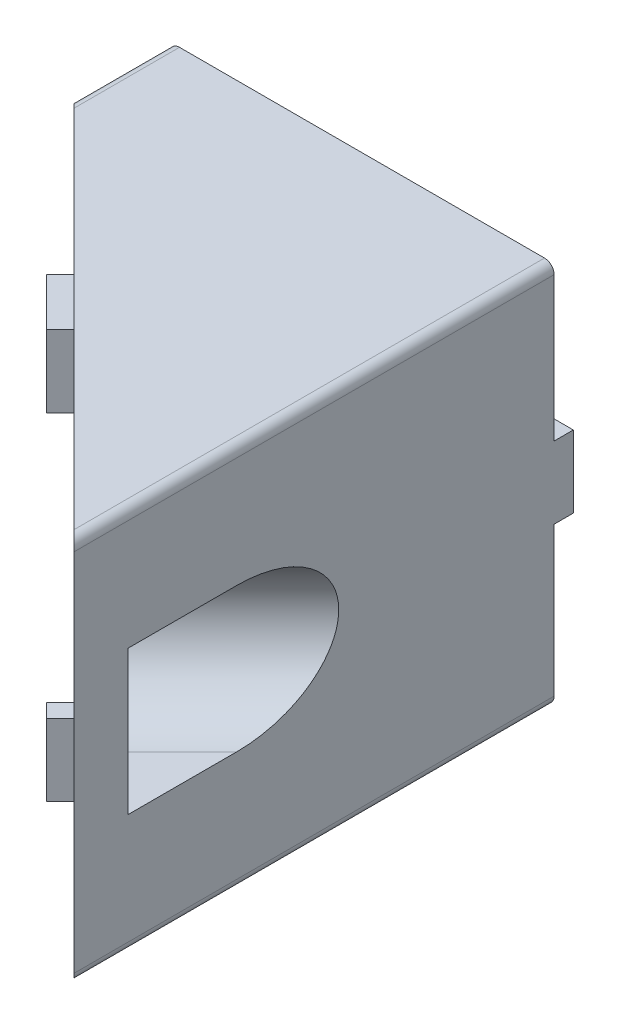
ISO-10303-21;
HEADER;
FILE_DESCRIPTION(('STEP AP214'),'2;1');
FILE_NAME('part.step','',(''),(''),'','','');
FILE_SCHEMA(('AUTOMOTIVE_DESIGN { 1 0 10303 214 1 1 1 1 }'));
ENDSEC;
DATA;
#1=APPLICATION_CONTEXT('core data for automotive mechanical design processes');
#2=APPLICATION_PROTOCOL_DEFINITION('international standard','automotive_design',2000,#1);
#3=PRODUCT_CONTEXT('',#1,'mechanical');
#4=PRODUCT('Part','Part','',(#3));
#5=PRODUCT_RELATED_PRODUCT_CATEGORY('part','',(#4));
#6=PRODUCT_DEFINITION_FORMATION('','',#4);
#7=PRODUCT_DEFINITION_CONTEXT('part definition',#1,'design');
#8=PRODUCT_DEFINITION('design','',#6,#7);
#9=PRODUCT_DEFINITION_SHAPE('','',#8);
#10=(LENGTH_UNIT() NAMED_UNIT(*) SI_UNIT(.MILLI.,.METRE.));
#11=(NAMED_UNIT(*) PLANE_ANGLE_UNIT() SI_UNIT($,.RADIAN.));
#12=(NAMED_UNIT(*) SI_UNIT($,.STERADIAN.) SOLID_ANGLE_UNIT());
#13=UNCERTAINTY_MEASURE_WITH_UNIT(LENGTH_MEASURE(1.E-05),#10,'distance_accuracy_value','');
#14=(GEOMETRIC_REPRESENTATION_CONTEXT(3) GLOBAL_UNCERTAINTY_ASSIGNED_CONTEXT((#13)) GLOBAL_UNIT_ASSIGNED_CONTEXT((#10,
#11,#12)) REPRESENTATION_CONTEXT('',''));
#15=CARTESIAN_POINT('',(0.,0.,0.));
#16=DIRECTION('',(0.,0.,1.));
#17=DIRECTION('',(1.,0.,0.));
#18=AXIS2_PLACEMENT_3D('',#15,#16,#17);
#19=CARTESIAN_POINT('',(0.,0.,-25.));
#20=DIRECTION('',(0.,0.,1.));
#21=DIRECTION('',(1.,0.,0.));
#22=AXIS2_PLACEMENT_3D('',#19,#20,#21);
#23=PLANE('',#22);
#24=CARTESIAN_POINT('',(0.,0.,-25.));
#25=DIRECTION('',(0.,0.,-1.));
#26=DIRECTION('',(-1.,0.,0.));
#27=AXIS2_PLACEMENT_3D('',#24,#25,#26);
#28=CIRCLE('',#27,4.);
#29=CARTESIAN_POINT('',(-4.,0.,-25.));
#30=VERTEX_POINT('',#29);
#31=EDGE_CURVE('E553',#30,#30,#28,.T.);
#32=ORIENTED_EDGE('',*,*,#31,.F.);
#33=EDGE_LOOP('',(#32));
#34=FACE_BOUND('',#33,.T.);
#35=DIRECTION('',(1.,0.,0.));
#36=VECTOR('',#35,1.);
#37=CARTESIAN_POINT('',(-20.,-20.,-25.));
#38=LINE('',#37,#36);
#39=CARTESIAN_POINT('',(-19.,-20.,-25.));
#40=VERTEX_POINT('',#39);
#41=CARTESIAN_POINT('',(19.,-20.,-25.));
#42=VERTEX_POINT('',#41);
#43=EDGE_CURVE('E359',#40,#42,#38,.T.);
#44=ORIENTED_EDGE('',*,*,#43,.F.);
#45=CARTESIAN_POINT('',(-19.,-19.,-25.));
#46=DIRECTION('',(0.,0.,1.));
#47=DIRECTION('',(1.,0.,0.));
#48=AXIS2_PLACEMENT_3D('',#45,#46,#47);
#49=CIRCLE('',#48,1.);
#50=CARTESIAN_POINT('',(-20.,-19.,-25.));
#51=VERTEX_POINT('',#50);
#52=EDGE_CURVE('E580',#40,#51,#49,.F.);
#53=ORIENTED_EDGE('',*,*,#52,.T.);
#54=DIRECTION('',(0.,-1.,0.));
#55=VECTOR('',#54,1.);
#56=CARTESIAN_POINT('',(-20.,20.,-25.));
#57=LINE('',#56,#55);
#58=CARTESIAN_POINT('',(-20.,-3.49999999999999,-25.));
#59=VERTEX_POINT('',#58);
#60=EDGE_CURVE('E556',#59,#51,#57,.T.);
#61=ORIENTED_EDGE('',*,*,#60,.F.);
#62=DIRECTION('',(-1.,0.,0.));
#63=VECTOR('',#62,1.);
#64=CARTESIAN_POINT('',(-20.,-3.49999999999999,-25.));
#65=LINE('',#64,#63);
#66=CARTESIAN_POINT('',(-18.,-3.49999999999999,-25.));
#67=VERTEX_POINT('',#66);
#68=EDGE_CURVE('E301',#67,#59,#65,.T.);
#69=ORIENTED_EDGE('',*,*,#68,.F.);
#70=DIRECTION('',(0.,-1.,0.));
#71=VECTOR('',#70,1.);
#72=CARTESIAN_POINT('',(-18.,4.00000000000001,-25.));
#73=LINE('',#72,#71);
#74=CARTESIAN_POINT('',(-18.,4.00000000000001,-25.));
#75=VERTEX_POINT('',#74);
#76=EDGE_CURVE('E1161',#75,#67,#73,.T.);
#77=ORIENTED_EDGE('',*,*,#76,.F.);
#78=DIRECTION('',(1.,0.,0.));
#79=VECTOR('',#78,1.);
#80=CARTESIAN_POINT('',(-20.,4.00000000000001,-25.));
#81=LINE('',#80,#79);
#82=CARTESIAN_POINT('',(-20.,4.00000000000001,-25.));
#83=VERTEX_POINT('',#82);
#84=EDGE_CURVE('E305',#83,#75,#81,.T.);
#85=ORIENTED_EDGE('',*,*,#84,.F.);
#86=CARTESIAN_POINT('',(-20.,19.,-25.));
#87=VERTEX_POINT('',#86);
#88=EDGE_CURVE('E560',#87,#83,#57,.T.);
#89=ORIENTED_EDGE('',*,*,#88,.F.);
#90=CARTESIAN_POINT('',(-19.,19.,-25.));
#91=DIRECTION('',(0.,0.,1.));
#92=DIRECTION('',(1.,0.,0.));
#93=AXIS2_PLACEMENT_3D('',#90,#91,#92);
#94=CIRCLE('',#93,1.);
#95=CARTESIAN_POINT('',(-19.,20.,-25.));
#96=VERTEX_POINT('',#95);
#97=EDGE_CURVE('E349',#87,#96,#94,.F.);
#98=ORIENTED_EDGE('',*,*,#97,.T.);
#99=DIRECTION('',(-1.,0.,0.));
#100=VECTOR('',#99,1.);
#101=CARTESIAN_POINT('',(-20.,20.,-25.));
#102=LINE('',#101,#100);
#103=CARTESIAN_POINT('',(19.,20.,-25.));
#104=VERTEX_POINT('',#103);
#105=EDGE_CURVE('E353',#104,#96,#102,.T.);
#106=ORIENTED_EDGE('',*,*,#105,.F.);
#107=CARTESIAN_POINT('',(19.,19.,-25.));
#108=DIRECTION('',(0.,0.,1.));
#109=DIRECTION('',(1.,0.,0.));
#110=AXIS2_PLACEMENT_3D('',#107,#108,#109);
#111=CIRCLE('',#110,1.);
#112=CARTESIAN_POINT('',(20.,19.,-25.));
#113=VERTEX_POINT('',#112);
#114=EDGE_CURVE('E620',#104,#113,#111,.F.);
#115=ORIENTED_EDGE('',*,*,#114,.T.);
#116=DIRECTION('',(0.,1.,0.));
#117=VECTOR('',#116,1.);
#118=CARTESIAN_POINT('',(20.,20.,-25.));
#119=LINE('',#118,#117);
#120=CARTESIAN_POINT('',(20.,4.00000000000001,-25.));
#121=VERTEX_POINT('',#120);
#122=EDGE_CURVE('E354',#121,#113,#119,.T.);
#123=ORIENTED_EDGE('',*,*,#122,.F.);
#124=DIRECTION('',(1.,0.,0.));
#125=VECTOR('',#124,1.);
#126=CARTESIAN_POINT('',(20.,4.00000000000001,-25.));
#127=LINE('',#126,#125);
#128=CARTESIAN_POINT('',(18.,4.00000000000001,-25.));
#129=VERTEX_POINT('',#128);
#130=EDGE_CURVE('E320',#129,#121,#127,.T.);
#131=ORIENTED_EDGE('',*,*,#130,.F.);
#132=DIRECTION('',(0.,1.,0.));
#133=VECTOR('',#132,1.);
#134=CARTESIAN_POINT('',(18.,4.00000000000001,-25.));
#135=LINE('',#134,#133);
#136=CARTESIAN_POINT('',(18.,-3.49999999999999,-25.));
#137=VERTEX_POINT('',#136);
#138=EDGE_CURVE('E310',#137,#129,#135,.T.);
#139=ORIENTED_EDGE('',*,*,#138,.F.);
#140=DIRECTION('',(-1.,0.,0.));
#141=VECTOR('',#140,1.);
#142=CARTESIAN_POINT('',(20.,-3.49999999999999,-25.));
#143=LINE('',#142,#141);
#144=CARTESIAN_POINT('',(20.,-3.49999999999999,-25.));
#145=VERTEX_POINT('',#144);
#146=EDGE_CURVE('E307',#145,#137,#143,.T.);
#147=ORIENTED_EDGE('',*,*,#146,.F.);
#148=CARTESIAN_POINT('',(20.,-19.,-25.));
#149=VERTEX_POINT('',#148);
#150=EDGE_CURVE('E350',#149,#145,#119,.T.);
#151=ORIENTED_EDGE('',*,*,#150,.F.);
#152=CARTESIAN_POINT('',(19.,-19.,-25.));
#153=DIRECTION('',(0.,0.,1.));
#154=DIRECTION('',(1.,0.,0.));
#155=AXIS2_PLACEMENT_3D('',#152,#153,#154);
#156=CIRCLE('',#155,1.);
#157=EDGE_CURVE('E607',#149,#42,#156,.F.);
#158=ORIENTED_EDGE('',*,*,#157,.T.);
#159=EDGE_LOOP('',(#44,#53,#61,#69,#77,#85,#89,#98,#106,#115,#123,#131,#139,#147,#151,#158));
#160=FACE_BOUND('',#159,.T.);
#161=ADVANCED_FACE('F36',(#34,#160),#23,.F.);
#162=CARTESIAN_POINT('',(20.,20.,25.));
#163=DIRECTION('',(0.707106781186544,0.,-0.707106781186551));
#164=DIRECTION('',(-0.707106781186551,0.,-0.707106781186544));
#165=AXIS2_PLACEMENT_3D('',#162,#163,#164);
#166=PLANE('',#165);
#167=DIRECTION('',(0.707106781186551,0.,0.707106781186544));
#168=VECTOR('',#167,1.);
#169=CARTESIAN_POINT('',(-16.5000000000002,-17.,-11.4999999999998));
#170=LINE('',#169,#168);
#171=CARTESIAN_POINT('',(-16.0000000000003,-17.,-11.));
#172=VERTEX_POINT('',#171);
#173=CARTESIAN_POINT('',(17.,-17.,22.));
#174=VERTEX_POINT('',#173);
#175=EDGE_CURVE('E501',#172,#174,#170,.T.);
#176=ORIENTED_EDGE('',*,*,#175,.F.);
#177=DIRECTION('',(0.,1.,0.));
#178=VECTOR('',#177,1.);
#179=CARTESIAN_POINT('',(-16.0000000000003,0.,-11.));
#180=LINE('',#179,#178);
#181=CARTESIAN_POINT('',(-16.0000000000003,-11.,-11.));
#182=VERTEX_POINT('',#181);
#183=EDGE_CURVE('E558',#172,#182,#180,.T.);
#184=ORIENTED_EDGE('',*,*,#183,.T.);
#185=DIRECTION('',(-0.707106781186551,0.,-0.707106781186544));
#186=VECTOR('',#185,1.);
#187=CARTESIAN_POINT('',(-16.5000000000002,-11.,-11.4999999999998));
#188=LINE('',#187,#186);
#189=CARTESIAN_POINT('',(17.,-11.,22.));
#190=VERTEX_POINT('',#189);
#191=EDGE_CURVE('E498',#190,#182,#188,.T.);
#192=ORIENTED_EDGE('',*,*,#191,.F.);
#193=DIRECTION('',(0.,1.,0.));
#194=VECTOR('',#193,1.);
#195=CARTESIAN_POINT('',(17.,-17.,22.));
#196=LINE('',#195,#194);
#197=EDGE_CURVE('E504',#174,#190,#196,.T.);
#198=ORIENTED_EDGE('',*,*,#197,.F.);
#199=EDGE_LOOP('',(#176,#184,#192,#198));
#200=FACE_BOUND('',#199,.T.);
#201=DIRECTION('',(0.,1.,0.));
#202=VECTOR('',#201,1.);
#203=CARTESIAN_POINT('',(17.,17.,22.));
#204=LINE('',#203,#202);
#205=CARTESIAN_POINT('',(17.,11.,22.));
#206=VERTEX_POINT('',#205);
#207=CARTESIAN_POINT('',(17.,17.,22.));
#208=VERTEX_POINT('',#207);
#209=EDGE_CURVE('E512',#206,#208,#204,.T.);
#210=ORIENTED_EDGE('',*,*,#209,.F.);
#211=DIRECTION('',(0.707106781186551,0.,0.707106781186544));
#212=VECTOR('',#211,1.);
#213=CARTESIAN_POINT('',(-16.5000000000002,11.,-11.4999999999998));
#214=LINE('',#213,#212);
#215=CARTESIAN_POINT('',(-16.0000000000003,11.,-11.));
#216=VERTEX_POINT('',#215);
#217=EDGE_CURVE('E509',#216,#206,#214,.T.);
#218=ORIENTED_EDGE('',*,*,#217,.F.);
#219=DIRECTION('',(0.,1.,0.));
#220=VECTOR('',#219,1.);
#221=CARTESIAN_POINT('',(-16.0000000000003,0.,-11.));
#222=LINE('',#221,#220);
#223=CARTESIAN_POINT('',(-16.0000000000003,17.,-11.));
#224=VERTEX_POINT('',#223);
#225=EDGE_CURVE('E507',#216,#224,#222,.T.);
#226=ORIENTED_EDGE('',*,*,#225,.T.);
#227=DIRECTION('',(-0.707106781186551,0.,-0.707106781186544));
#228=VECTOR('',#227,1.);
#229=CARTESIAN_POINT('',(-16.5000000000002,17.,-11.4999999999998));
#230=LINE('',#229,#228);
#231=EDGE_CURVE('E515',#208,#224,#230,.T.);
#232=ORIENTED_EDGE('',*,*,#231,.F.);
#233=EDGE_LOOP('',(#210,#218,#226,#232));
#234=FACE_BOUND('',#233,.T.);
#235=CARTESIAN_POINT('',(11.5147186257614,0.,16.5147186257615));
#236=DIRECTION('',(-0.707106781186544,0.,0.707106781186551));
#237=DIRECTION('',(0.707106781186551,0.,0.707106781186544));
#238=AXIS2_PLACEMENT_3D('',#235,#236,#237);
#239=CIRCLE('',#238,4.25);
#240=CARTESIAN_POINT('',(14.5199224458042,0.,19.5199224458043));
#241=VERTEX_POINT('',#240);
#242=EDGE_CURVE('E487',#241,#241,#239,.T.);
#243=ORIENTED_EDGE('',*,*,#242,.F.);
#244=EDGE_LOOP('',(#243));
#245=FACE_BOUND('',#244,.T.);
#246=DIRECTION('',(0.,-1.,0.));
#247=VECTOR('',#246,1.);
#248=CARTESIAN_POINT('',(-20.,20.,-14.9999999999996));
#249=LINE('',#248,#247);
#250=CARTESIAN_POINT('',(-20.,-3.5,-14.9999999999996));
#251=VERTEX_POINT('',#250);
#252=CARTESIAN_POINT('',(-20.,-19.,-14.9999999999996));
#253=VERTEX_POINT('',#252);
#254=EDGE_CURVE('E493',#251,#253,#249,.T.);
#255=ORIENTED_EDGE('',*,*,#254,.T.);
#256=CARTESIAN_POINT('',(-19.,-19.,-13.9999999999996));
#257=DIRECTION('',(0.707106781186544,0.,-0.707106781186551));
#258=DIRECTION('',(-0.707106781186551,0.,-0.707106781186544));
#259=AXIS2_PLACEMENT_3D('',#256,#257,#258);
#260=ELLIPSE('',#259,1.41421356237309,1.);
#261=CARTESIAN_POINT('',(-19.,-20.,-13.9999999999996));
#262=VERTEX_POINT('',#261);
#263=EDGE_CURVE('E581',#253,#262,#260,.F.);
#264=ORIENTED_EDGE('',*,*,#263,.T.);
#265=DIRECTION('',(0.707106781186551,0.,0.707106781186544));
#266=VECTOR('',#265,1.);
#267=CARTESIAN_POINT('',(20.,-20.,25.));
#268=LINE('',#267,#266);
#269=CARTESIAN_POINT('',(19.,-20.,24.));
#270=VERTEX_POINT('',#269);
#271=EDGE_CURVE('E490',#262,#270,#268,.T.);
#272=ORIENTED_EDGE('',*,*,#271,.T.);
#273=CARTESIAN_POINT('',(19.,-19.,24.));
#274=DIRECTION('',(0.707106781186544,0.,-0.707106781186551));
#275=DIRECTION('',(-0.707106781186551,0.,-0.707106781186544));
#276=AXIS2_PLACEMENT_3D('',#273,#274,#275);
#277=ELLIPSE('',#276,1.41421356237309,1.);
#278=CARTESIAN_POINT('',(20.,-19.,25.));
#279=VERTEX_POINT('',#278);
#280=EDGE_CURVE('E590',#270,#279,#277,.F.);
#281=ORIENTED_EDGE('',*,*,#280,.T.);
#282=DIRECTION('',(0.,1.,0.));
#283=VECTOR('',#282,1.);
#284=CARTESIAN_POINT('',(20.,20.,25.));
#285=LINE('',#284,#283);
#286=CARTESIAN_POINT('',(20.,-3.49999999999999,25.));
#287=VERTEX_POINT('',#286);
#288=EDGE_CURVE('E557',#279,#287,#285,.T.);
#289=ORIENTED_EDGE('',*,*,#288,.T.);
#290=DIRECTION('',(0.707106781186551,0.,0.707106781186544));
#291=VECTOR('',#290,1.);
#292=CARTESIAN_POINT('',(20.,-3.49999999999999,25.));
#293=LINE('',#292,#291);
#294=CARTESIAN_POINT('',(18.5857864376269,-3.49999999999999,23.5857864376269));
#295=VERTEX_POINT('',#294);
#296=EDGE_CURVE('E412',#295,#287,#293,.T.);
#297=ORIENTED_EDGE('',*,*,#296,.F.);
#298=DIRECTION('',(0.,-1.,0.));
#299=VECTOR('',#298,1.);
#300=CARTESIAN_POINT('',(18.5857864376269,4.00000000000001,23.5857864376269));
#301=LINE('',#300,#299);
#302=CARTESIAN_POINT('',(18.5857864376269,4.,23.5857864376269));
#303=VERTEX_POINT('',#302);
#304=EDGE_CURVE('E424',#303,#295,#301,.T.);
#305=ORIENTED_EDGE('',*,*,#304,.F.);
#306=DIRECTION('',(-0.707106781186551,0.,-0.707106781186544));
#307=VECTOR('',#306,1.);
#308=CARTESIAN_POINT('',(20.,4.00000000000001,25.));
#309=LINE('',#308,#307);
#310=CARTESIAN_POINT('',(20.,4.00000000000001,25.));
#311=VERTEX_POINT('',#310);
#312=EDGE_CURVE('E421',#311,#303,#309,.T.);
#313=ORIENTED_EDGE('',*,*,#312,.F.);
#314=CARTESIAN_POINT('',(20.,19.,25.));
#315=VERTEX_POINT('',#314);
#316=EDGE_CURVE('E559',#311,#315,#285,.T.);
#317=ORIENTED_EDGE('',*,*,#316,.T.);
#318=CARTESIAN_POINT('',(19.,19.,24.));
#319=DIRECTION('',(0.707106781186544,0.,-0.707106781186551));
#320=DIRECTION('',(-0.707106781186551,0.,-0.707106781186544));
#321=AXIS2_PLACEMENT_3D('',#318,#319,#320);
#322=ELLIPSE('',#321,1.41421356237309,1.);
#323=CARTESIAN_POINT('',(19.,20.,24.));
#324=VERTEX_POINT('',#323);
#325=EDGE_CURVE('E51',#315,#324,#322,.F.);
#326=ORIENTED_EDGE('',*,*,#325,.T.);
#327=DIRECTION('',(0.707106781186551,0.,0.707106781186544));
#328=VECTOR('',#327,1.);
#329=CARTESIAN_POINT('',(20.,20.,25.));
#330=LINE('',#329,#328);
#331=CARTESIAN_POINT('',(-19.,20.,-13.9999999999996));
#332=VERTEX_POINT('',#331);
#333=EDGE_CURVE('E491',#332,#324,#330,.T.);
#334=ORIENTED_EDGE('',*,*,#333,.F.);
#335=CARTESIAN_POINT('',(-19.,19.,-13.9999999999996));
#336=DIRECTION('',(0.707106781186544,0.,-0.707106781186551));
#337=DIRECTION('',(-0.707106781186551,0.,-0.707106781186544));
#338=AXIS2_PLACEMENT_3D('',#335,#336,#337);
#339=ELLIPSE('',#338,1.41421356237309,1.);
#340=CARTESIAN_POINT('',(-20.,19.,-14.9999999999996));
#341=VERTEX_POINT('',#340);
#342=EDGE_CURVE('E582',#332,#341,#339,.F.);
#343=ORIENTED_EDGE('',*,*,#342,.T.);
#344=CARTESIAN_POINT('',(-20.,4.,-14.9999999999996));
#345=VERTEX_POINT('',#344);
#346=EDGE_CURVE('E496',#341,#345,#249,.T.);
#347=ORIENTED_EDGE('',*,*,#346,.T.);
#348=DIRECTION('',(-0.707106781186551,0.,-0.707106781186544));
#349=VECTOR('',#348,1.);
#350=CARTESIAN_POINT('',(-20.,4.,-14.9999999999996));
#351=LINE('',#350,#349);
#352=CARTESIAN_POINT('',(-15.0502525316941,4.,-10.0502525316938));
#353=VERTEX_POINT('',#352);
#354=EDGE_CURVE('E445',#353,#345,#351,.T.);
#355=ORIENTED_EDGE('',*,*,#354,.F.);
#356=DIRECTION('',(0.,1.,0.));
#357=VECTOR('',#356,1.);
#358=CARTESIAN_POINT('',(-15.0502525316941,20.,-10.0502525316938));
#359=LINE('',#358,#357);
#360=CARTESIAN_POINT('',(-15.0502525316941,7.5,-10.0502525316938));
#361=VERTEX_POINT('',#360);
#362=EDGE_CURVE('E387',#353,#361,#359,.T.);
#363=ORIENTED_EDGE('',*,*,#362,.T.);
#364=DIRECTION('',(-0.707106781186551,0.,-0.707106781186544));
#365=VECTOR('',#364,1.);
#366=CARTESIAN_POINT('',(20.,7.5,25.));
#367=LINE('',#366,#365);
#368=CARTESIAN_POINT('',(0.,7.5,5.00000000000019));
#369=VERTEX_POINT('',#368);
#370=EDGE_CURVE('E405',#369,#361,#367,.T.);
#371=ORIENTED_EDGE('',*,*,#370,.F.);
#372=CARTESIAN_POINT('',(0.,0.,5.00000000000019));
#373=DIRECTION('',(0.707106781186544,0.,-0.707106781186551));
#374=DIRECTION('',(0.707106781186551,0.,0.707106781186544));
#375=AXIS2_PLACEMENT_3D('',#372,#373,#374);
#376=ELLIPSE('',#375,10.6066017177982,7.5);
#377=CARTESIAN_POINT('',(0.,-7.5,5.00000000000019));
#378=VERTEX_POINT('',#377);
#379=EDGE_CURVE('E518',#378,#369,#376,.F.);
#380=ORIENTED_EDGE('',*,*,#379,.F.);
#381=DIRECTION('',(0.707106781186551,0.,0.707106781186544));
#382=VECTOR('',#381,1.);
#383=CARTESIAN_POINT('',(20.,-7.5,25.));
#384=LINE('',#383,#382);
#385=CARTESIAN_POINT('',(-15.0502525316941,-7.5,-10.0502525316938));
#386=VERTEX_POINT('',#385);
#387=EDGE_CURVE('E403',#386,#378,#384,.T.);
#388=ORIENTED_EDGE('',*,*,#387,.F.);
#389=CARTESIAN_POINT('',(-15.0502525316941,-3.5,-10.0502525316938));
#390=VERTEX_POINT('',#389);
#391=EDGE_CURVE('E390',#386,#390,#359,.T.);
#392=ORIENTED_EDGE('',*,*,#391,.T.);
#393=DIRECTION('',(0.707106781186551,0.,0.707106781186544));
#394=VECTOR('',#393,1.);
#395=CARTESIAN_POINT('',(-20.,-3.5,-14.9999999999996));
#396=LINE('',#395,#394);
#397=EDGE_CURVE('E454',#251,#390,#396,.T.);
#398=ORIENTED_EDGE('',*,*,#397,.F.);
#399=EDGE_LOOP('',(#255,#264,#272,#281,#289,#297,#305,#313,#317,#326,#334,#343,#347,#355,#363,
#371,#380,#388,#392,#398));
#400=FACE_BOUND('',#399,.T.);
#401=ADVANCED_FACE('F629',(#200,#234,#245,#400),#166,.F.);
#402=CARTESIAN_POINT('',(0.,0.,25.));
#403=DIRECTION('',(0.,0.,-1.));
#404=DIRECTION('',(-1.,0.,0.));
#405=AXIS2_PLACEMENT_3D('',#402,#403,#404);
#406=CYLINDRICAL_SURFACE('',#405,4.);
#407=ORIENTED_EDGE('',*,*,#31,.T.);
#408=EDGE_LOOP('',(#407));
#409=FACE_BOUND('',#408,.T.);
#410=CARTESIAN_POINT('',(0.,0.,-17.));
#411=DIRECTION('',(0.,0.,1.));
#412=DIRECTION('',(1.,0.,0.));
#413=AXIS2_PLACEMENT_3D('',#410,#411,#412);
#414=CIRCLE('',#413,4.);
#415=CARTESIAN_POINT('',(4.,0.,-17.));
#416=VERTEX_POINT('',#415);
#417=EDGE_CURVE('E552',#416,#416,#414,.F.);
#418=ORIENTED_EDGE('',*,*,#417,.F.);
#419=EDGE_LOOP('',(#418));
#420=FACE_BOUND('',#419,.T.);
#421=ADVANCED_FACE('F665',(#409,#420),#406,.F.);
#422=CARTESIAN_POINT('',(-20.,20.,25.));
#423=DIRECTION('',(1.,0.,0.));
#424=DIRECTION('',(0.,1.,0.));
#425=AXIS2_PLACEMENT_3D('',#422,#423,#424);
#426=PLANE('',#425);
#427=ORIENTED_EDGE('',*,*,#60,.T.);
#428=DIRECTION('',(0.,0.,-1.));
#429=VECTOR('',#428,1.);
#430=CARTESIAN_POINT('',(-20.,-19.,25.));
#431=LINE('',#430,#429);
#432=EDGE_CURVE('E570',#51,#253,#431,.F.);
#433=ORIENTED_EDGE('',*,*,#432,.T.);
#434=ORIENTED_EDGE('',*,*,#254,.F.);
#435=DIRECTION('',(0.,-1.,0.));
#436=VECTOR('',#435,1.);
#437=CARTESIAN_POINT('',(-20.,4.,-14.9999999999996));
#438=LINE('',#437,#436);
#439=EDGE_CURVE('E440',#345,#251,#438,.T.);
#440=ORIENTED_EDGE('',*,*,#439,.F.);
#441=ORIENTED_EDGE('',*,*,#346,.F.);
#442=DIRECTION('',(0.,0.,-1.));
#443=VECTOR('',#442,1.);
#444=CARTESIAN_POINT('',(-20.,19.,25.));
#445=LINE('',#444,#443);
#446=EDGE_CURVE('E583',#341,#87,#445,.T.);
#447=ORIENTED_EDGE('',*,*,#446,.T.);
#448=ORIENTED_EDGE('',*,*,#88,.T.);
#449=DIRECTION('',(0.,0.,1.));
#450=VECTOR('',#449,1.);
#451=CARTESIAN_POINT('',(-20.,4.00000000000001,-27.));
#452=LINE('',#451,#450);
#453=CARTESIAN_POINT('',(-20.,4.00000000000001,-27.));
#454=VERTEX_POINT('',#453);
#455=EDGE_CURVE('E1166',#454,#83,#452,.T.);
#456=ORIENTED_EDGE('',*,*,#455,.F.);
#457=DIRECTION('',(0.,1.,0.));
#458=VECTOR('',#457,1.);
#459=CARTESIAN_POINT('',(-20.,4.00000000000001,-27.));
#460=LINE('',#459,#458);
#461=CARTESIAN_POINT('',(-20.,-3.49999999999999,-27.));
#462=VERTEX_POINT('',#461);
#463=EDGE_CURVE('E297',#462,#454,#460,.T.);
#464=ORIENTED_EDGE('',*,*,#463,.F.);
#465=DIRECTION('',(0.,0.,1.));
#466=VECTOR('',#465,1.);
#467=CARTESIAN_POINT('',(-20.,-3.49999999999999,-27.));
#468=LINE('',#467,#466);
#469=EDGE_CURVE('E312',#462,#59,#468,.T.);
#470=ORIENTED_EDGE('',*,*,#469,.T.);
#471=EDGE_LOOP('',(#427,#433,#434,#440,#441,#447,#448,#456,#464,#470));
#472=FACE_BOUND('',#471,.T.);
#473=ADVANCED_FACE('F568',(#472),#426,.F.);
#474=CARTESIAN_POINT('',(-20.,-20.,25.));
#475=DIRECTION('',(0.,1.,0.));
#476=DIRECTION('',(-1.,0.,0.));
#477=AXIS2_PLACEMENT_3D('',#474,#475,#476);
#478=PLANE('',#477);
#479=ORIENTED_EDGE('',*,*,#271,.F.);
#480=DIRECTION('',(0.,0.,-1.));
#481=VECTOR('',#480,1.);
#482=CARTESIAN_POINT('',(-19.,-20.,25.));
#483=LINE('',#482,#481);
#484=EDGE_CURVE('E345',#262,#40,#483,.T.);
#485=ORIENTED_EDGE('',*,*,#484,.T.);
#486=ORIENTED_EDGE('',*,*,#43,.T.);
#487=DIRECTION('',(0.,0.,-1.));
#488=VECTOR('',#487,1.);
#489=CARTESIAN_POINT('',(19.,-20.,25.));
#490=LINE('',#489,#488);
#491=EDGE_CURVE('E343',#42,#270,#490,.F.);
#492=ORIENTED_EDGE('',*,*,#491,.T.);
#493=EDGE_LOOP('',(#479,#485,#486,#492));
#494=FACE_BOUND('',#493,.T.);
#495=ADVANCED_FACE('F627',(#494),#478,.F.);
#496=CARTESIAN_POINT('',(20.,20.,25.));
#497=DIRECTION('',(-1.,0.,0.));
#498=DIRECTION('',(0.,-1.,0.));
#499=AXIS2_PLACEMENT_3D('',#496,#497,#498);
#500=PLANE('',#499);
#501=DIRECTION('',(0.,1.,0.));
#502=VECTOR('',#501,1.);
#503=CARTESIAN_POINT('',(20.,7.5,19.3431457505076));
#504=LINE('',#503,#502);
#505=CARTESIAN_POINT('',(20.,-7.5,19.3431457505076));
#506=VERTEX_POINT('',#505);
#507=CARTESIAN_POINT('',(20.,7.5,19.3431457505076));
#508=VERTEX_POINT('',#507);
#509=EDGE_CURVE('E476',#506,#508,#504,.T.);
#510=ORIENTED_EDGE('',*,*,#509,.T.);
#511=DIRECTION('',(0.,0.,-1.));
#512=VECTOR('',#511,1.);
#513=CARTESIAN_POINT('',(20.,7.5,25.));
#514=LINE('',#513,#512);
#515=CARTESIAN_POINT('',(20.,7.5,8.02943725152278));
#516=VERTEX_POINT('',#515);
#517=EDGE_CURVE('E825',#508,#516,#514,.T.);
#518=ORIENTED_EDGE('',*,*,#517,.T.);
#519=CARTESIAN_POINT('',(20.,0.,8.02943725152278));
#520=DIRECTION('',(-1.,0.,0.));
#521=DIRECTION('',(0.,0.,1.));
#522=AXIS2_PLACEMENT_3D('',#519,#520,#521);
#523=ELLIPSE('',#522,10.6066017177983,7.5);
#524=CARTESIAN_POINT('',(20.,-7.5,8.02943725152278));
#525=VERTEX_POINT('',#524);
#526=EDGE_CURVE('E827',#516,#525,#523,.T.);
#527=ORIENTED_EDGE('',*,*,#526,.T.);
#528=DIRECTION('',(0.,0.,1.));
#529=VECTOR('',#528,1.);
#530=CARTESIAN_POINT('',(20.,-7.5,25.));
#531=LINE('',#530,#529);
#532=EDGE_CURVE('E832',#525,#506,#531,.T.);
#533=ORIENTED_EDGE('',*,*,#532,.T.);
#534=EDGE_LOOP('',(#510,#518,#527,#533));
#535=FACE_BOUND('',#534,.T.);
#536=ORIENTED_EDGE('',*,*,#288,.F.);
#537=DIRECTION('',(0.,0.,-1.));
#538=VECTOR('',#537,1.);
#539=CARTESIAN_POINT('',(20.,-19.,25.));
#540=LINE('',#539,#538);
#541=EDGE_CURVE('E595',#279,#149,#540,.T.);
#542=ORIENTED_EDGE('',*,*,#541,.T.);
#543=ORIENTED_EDGE('',*,*,#150,.T.);
#544=DIRECTION('',(0.,0.,1.));
#545=VECTOR('',#544,1.);
#546=CARTESIAN_POINT('',(20.,-3.49999999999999,-27.));
#547=LINE('',#546,#545);
#548=CARTESIAN_POINT('',(20.,-3.49999999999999,-27.));
#549=VERTEX_POINT('',#548);
#550=EDGE_CURVE('E369',#549,#145,#547,.T.);
#551=ORIENTED_EDGE('',*,*,#550,.F.);
#552=DIRECTION('',(0.,-1.,0.));
#553=VECTOR('',#552,1.);
#554=CARTESIAN_POINT('',(20.,4.00000000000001,-27.));
#555=LINE('',#554,#553);
#556=CARTESIAN_POINT('',(20.,4.00000000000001,-27.));
#557=VERTEX_POINT('',#556);
#558=EDGE_CURVE('E316',#557,#549,#555,.T.);
#559=ORIENTED_EDGE('',*,*,#558,.F.);
#560=DIRECTION('',(0.,0.,1.));
#561=VECTOR('',#560,1.);
#562=CARTESIAN_POINT('',(20.,4.00000000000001,-27.));
#563=LINE('',#562,#561);
#564=EDGE_CURVE('E326',#557,#121,#563,.T.);
#565=ORIENTED_EDGE('',*,*,#564,.T.);
#566=ORIENTED_EDGE('',*,*,#122,.T.);
#567=DIRECTION('',(0.,0.,-1.));
#568=VECTOR('',#567,1.);
#569=CARTESIAN_POINT('',(20.,19.,25.));
#570=LINE('',#569,#568);
#571=EDGE_CURVE('E593',#113,#315,#570,.F.);
#572=ORIENTED_EDGE('',*,*,#571,.T.);
#573=ORIENTED_EDGE('',*,*,#316,.F.);
#574=DIRECTION('',(0.,1.,0.));
#575=VECTOR('',#574,1.);
#576=CARTESIAN_POINT('',(20.,4.00000000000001,25.));
#577=LINE('',#576,#575);
#578=EDGE_CURVE('E407',#287,#311,#577,.T.);
#579=ORIENTED_EDGE('',*,*,#578,.F.);
#580=EDGE_LOOP('',(#536,#542,#543,#551,#559,#565,#566,#572,#573,#579));
#581=FACE_BOUND('',#580,.T.);
#582=ADVANCED_FACE('F601',(#535,#581),#500,.F.);
#583=CARTESIAN_POINT('',(-20.,20.,25.));
#584=DIRECTION('',(0.,-1.,0.));
#585=DIRECTION('',(0.,0.,-1.));
#586=AXIS2_PLACEMENT_3D('',#583,#584,#585);
#587=PLANE('',#586);
#588=ORIENTED_EDGE('',*,*,#333,.T.);
#589=DIRECTION('',(0.,0.,-1.));
#590=VECTOR('',#589,1.);
#591=CARTESIAN_POINT('',(19.,20.,25.));
#592=LINE('',#591,#590);
#593=EDGE_CURVE('E11',#324,#104,#592,.T.);
#594=ORIENTED_EDGE('',*,*,#593,.T.);
#595=ORIENTED_EDGE('',*,*,#105,.T.);
#596=DIRECTION('',(0.,0.,-1.));
#597=VECTOR('',#596,1.);
#598=CARTESIAN_POINT('',(-19.,20.,25.));
#599=LINE('',#598,#597);
#600=EDGE_CURVE('E44',#96,#332,#599,.F.);
#601=ORIENTED_EDGE('',*,*,#600,.T.);
#602=EDGE_LOOP('',(#588,#594,#595,#601));
#603=FACE_BOUND('',#602,.T.);
#604=ADVANCED_FACE('F649',(#603),#587,.F.);
#605=CARTESIAN_POINT('',(0.,0.,-17.));
#606=DIRECTION('',(0.,0.,1.));
#607=DIRECTION('',(1.,0.,0.));
#608=AXIS2_PLACEMENT_3D('',#605,#606,#607);
#609=PLANE('',#608);
#610=ORIENTED_EDGE('',*,*,#417,.T.);
#611=EDGE_LOOP('',(#610));
#612=FACE_BOUND('',#611,.T.);
#613=CARTESIAN_POINT('',(0.,0.,-17.));
#614=DIRECTION('',(0.,0.,1.));
#615=DIRECTION('',(1.,0.,0.));
#616=AXIS2_PLACEMENT_3D('',#613,#614,#615);
#617=CIRCLE('',#616,7.5);
#618=CARTESIAN_POINT('',(0.,-7.5,-17.));
#619=VERTEX_POINT('',#618);
#620=CARTESIAN_POINT('',(0.,7.5,-17.));
#621=VERTEX_POINT('',#620);
#622=EDGE_CURVE('E547',#619,#621,#617,.T.);
#623=ORIENTED_EDGE('',*,*,#622,.T.);
#624=DIRECTION('',(-1.,0.,0.));
#625=VECTOR('',#624,1.);
#626=CARTESIAN_POINT('',(0.,7.5,-17.));
#627=LINE('',#626,#625);
#628=CARTESIAN_POINT('',(-9.,7.5,-17.));
#629=VERTEX_POINT('',#628);
#630=EDGE_CURVE('E391',#621,#629,#627,.T.);
#631=ORIENTED_EDGE('',*,*,#630,.T.);
#632=DIRECTION('',(0.,-1.,0.));
#633=VECTOR('',#632,1.);
#634=CARTESIAN_POINT('',(-9.,7.5,-17.));
#635=LINE('',#634,#633);
#636=CARTESIAN_POINT('',(-9.,-7.5,-17.));
#637=VERTEX_POINT('',#636);
#638=EDGE_CURVE('E394',#629,#637,#635,.T.);
#639=ORIENTED_EDGE('',*,*,#638,.T.);
#640=DIRECTION('',(1.,0.,0.));
#641=VECTOR('',#640,1.);
#642=CARTESIAN_POINT('',(0.,-7.5,-17.));
#643=LINE('',#642,#641);
#644=EDGE_CURVE('E397',#637,#619,#643,.T.);
#645=ORIENTED_EDGE('',*,*,#644,.T.);
#646=EDGE_LOOP('',(#623,#631,#639,#645));
#647=FACE_BOUND('',#646,.T.);
#648=ADVANCED_FACE('F674',(#612,#647),#609,.T.);
#649=CARTESIAN_POINT('',(0.,0.,-17.));
#650=DIRECTION('',(0.,0.,1.));
#651=DIRECTION('',(1.,0.,0.));
#652=AXIS2_PLACEMENT_3D('',#649,#650,#651);
#653=CYLINDRICAL_SURFACE('',#652,7.5);
#654=ORIENTED_EDGE('',*,*,#379,.T.);
#655=DIRECTION('',(0.,0.,1.));
#656=VECTOR('',#655,1.);
#657=CARTESIAN_POINT('',(0.,7.5,-17.));
#658=LINE('',#657,#656);
#659=EDGE_CURVE('E346',#369,#621,#658,.F.);
#660=ORIENTED_EDGE('',*,*,#659,.T.);
#661=ORIENTED_EDGE('',*,*,#622,.F.);
#662=DIRECTION('',(0.,0.,1.));
#663=VECTOR('',#662,1.);
#664=CARTESIAN_POINT('',(0.,-7.5,-17.));
#665=LINE('',#664,#663);
#666=EDGE_CURVE('E815',#378,#619,#665,.F.);
#667=ORIENTED_EDGE('',*,*,#666,.F.);
#668=EDGE_LOOP('',(#654,#660,#661,#667));
#669=FACE_BOUND('',#668,.T.);
#670=ADVANCED_FACE('F792',(#669),#653,.F.);
#671=CARTESIAN_POINT('',(0.,0.,-11.));
#672=DIRECTION('',(0.,0.,1.));
#673=DIRECTION('',(1.,0.,0.));
#674=AXIS2_PLACEMENT_3D('',#671,#672,#673);
#675=PLANE('',#674);
#676=ORIENTED_EDGE('',*,*,#225,.F.);
#677=DIRECTION('',(1.,0.,0.));
#678=VECTOR('',#677,1.);
#679=CARTESIAN_POINT('',(-17.,11.,-11.));
#680=LINE('',#679,#678);
#681=CARTESIAN_POINT('',(17.,11.,-11.));
#682=VERTEX_POINT('',#681);
#683=EDGE_CURVE('E533',#216,#682,#680,.T.);
#684=ORIENTED_EDGE('',*,*,#683,.T.);
#685=DIRECTION('',(0.,1.,0.));
#686=VECTOR('',#685,1.);
#687=CARTESIAN_POINT('',(17.,17.,-11.));
#688=LINE('',#687,#686);
#689=CARTESIAN_POINT('',(17.,17.,-11.));
#690=VERTEX_POINT('',#689);
#691=EDGE_CURVE('E537',#682,#690,#688,.T.);
#692=ORIENTED_EDGE('',*,*,#691,.T.);
#693=DIRECTION('',(-1.,0.,0.));
#694=VECTOR('',#693,1.);
#695=CARTESIAN_POINT('',(-17.,17.,-11.));
#696=LINE('',#695,#694);
#697=EDGE_CURVE('E540',#690,#224,#696,.T.);
#698=ORIENTED_EDGE('',*,*,#697,.T.);
#699=EDGE_LOOP('',(#676,#684,#692,#698));
#700=FACE_BOUND('',#699,.T.);
#701=ADVANCED_FACE('F788',(#700),#675,.T.);
#702=CARTESIAN_POINT('',(-17.,11.,-11.));
#703=DIRECTION('',(0.,-1.,0.));
#704=DIRECTION('',(0.,0.,-1.));
#705=AXIS2_PLACEMENT_3D('',#702,#703,#704);
#706=PLANE('',#705);
#707=ORIENTED_EDGE('',*,*,#683,.F.);
#708=ORIENTED_EDGE('',*,*,#217,.T.);
#709=DIRECTION('',(0.,0.,1.));
#710=VECTOR('',#709,1.);
#711=CARTESIAN_POINT('',(17.,11.,-11.));
#712=LINE('',#711,#710);
#713=EDGE_CURVE('E543',#682,#206,#712,.T.);
#714=ORIENTED_EDGE('',*,*,#713,.F.);
#715=EDGE_LOOP('',(#707,#708,#714));
#716=FACE_BOUND('',#715,.T.);
#717=ADVANCED_FACE('F791',(#716),#706,.F.);
#718=CARTESIAN_POINT('',(17.,17.,-11.));
#719=DIRECTION('',(1.,0.,0.));
#720=DIRECTION('',(0.,0.,-1.));
#721=AXIS2_PLACEMENT_3D('',#718,#719,#720);
#722=PLANE('',#721);
#723=ORIENTED_EDGE('',*,*,#713,.T.);
#724=ORIENTED_EDGE('',*,*,#209,.T.);
#725=DIRECTION('',(0.,0.,1.));
#726=VECTOR('',#725,1.);
#727=CARTESIAN_POINT('',(17.,17.,-11.));
#728=LINE('',#727,#726);
#729=EDGE_CURVE('E544',#690,#208,#728,.T.);
#730=ORIENTED_EDGE('',*,*,#729,.F.);
#731=ORIENTED_EDGE('',*,*,#691,.F.);
#732=EDGE_LOOP('',(#723,#724,#730,#731));
#733=FACE_BOUND('',#732,.T.);
#734=ADVANCED_FACE('F796',(#733),#722,.F.);
#735=CARTESIAN_POINT('',(-17.,17.,-11.));
#736=DIRECTION('',(0.,1.,0.));
#737=DIRECTION('',(0.,0.,1.));
#738=AXIS2_PLACEMENT_3D('',#735,#736,#737);
#739=PLANE('',#738);
#740=ORIENTED_EDGE('',*,*,#729,.T.);
#741=ORIENTED_EDGE('',*,*,#231,.T.);
#742=ORIENTED_EDGE('',*,*,#697,.F.);
#743=EDGE_LOOP('',(#740,#741,#742));
#744=FACE_BOUND('',#743,.T.);
#745=ADVANCED_FACE('F776',(#744),#739,.F.);
#746=CARTESIAN_POINT('',(0.,0.,-11.));
#747=DIRECTION('',(0.,0.,1.));
#748=DIRECTION('',(1.,0.,0.));
#749=AXIS2_PLACEMENT_3D('',#746,#747,#748);
#750=PLANE('',#749);
#751=ORIENTED_EDGE('',*,*,#183,.F.);
#752=DIRECTION('',(1.,0.,0.));
#753=VECTOR('',#752,1.);
#754=CARTESIAN_POINT('',(-17.,-17.,-11.));
#755=LINE('',#754,#753);
#756=CARTESIAN_POINT('',(17.,-17.,-11.));
#757=VERTEX_POINT('',#756);
#758=EDGE_CURVE('E521',#172,#757,#755,.T.);
#759=ORIENTED_EDGE('',*,*,#758,.T.);
#760=DIRECTION('',(0.,1.,0.));
#761=VECTOR('',#760,1.);
#762=CARTESIAN_POINT('',(17.,-17.,-11.));
#763=LINE('',#762,#761);
#764=CARTESIAN_POINT('',(17.,-11.,-11.));
#765=VERTEX_POINT('',#764);
#766=EDGE_CURVE('E523',#757,#765,#763,.T.);
#767=ORIENTED_EDGE('',*,*,#766,.T.);
#768=DIRECTION('',(-1.,0.,0.));
#769=VECTOR('',#768,1.);
#770=CARTESIAN_POINT('',(-17.,-11.,-11.));
#771=LINE('',#770,#769);
#772=EDGE_CURVE('E526',#765,#182,#771,.T.);
#773=ORIENTED_EDGE('',*,*,#772,.T.);
#774=EDGE_LOOP('',(#751,#759,#767,#773));
#775=FACE_BOUND('',#774,.T.);
#776=ADVANCED_FACE('F772',(#775),#750,.T.);
#777=CARTESIAN_POINT('',(17.,-17.,-11.));
#778=DIRECTION('',(1.,0.,0.));
#779=DIRECTION('',(0.,0.,-1.));
#780=AXIS2_PLACEMENT_3D('',#777,#778,#779);
#781=PLANE('',#780);
#782=DIRECTION('',(0.,0.,1.));
#783=VECTOR('',#782,1.);
#784=CARTESIAN_POINT('',(17.,-17.,-11.));
#785=LINE('',#784,#783);
#786=EDGE_CURVE('E529',#757,#174,#785,.T.);
#787=ORIENTED_EDGE('',*,*,#786,.T.);
#788=ORIENTED_EDGE('',*,*,#197,.T.);
#789=DIRECTION('',(0.,0.,1.));
#790=VECTOR('',#789,1.);
#791=CARTESIAN_POINT('',(17.,-11.,-11.));
#792=LINE('',#791,#790);
#793=EDGE_CURVE('E530',#765,#190,#792,.T.);
#794=ORIENTED_EDGE('',*,*,#793,.F.);
#795=ORIENTED_EDGE('',*,*,#766,.F.);
#796=EDGE_LOOP('',(#787,#788,#794,#795));
#797=FACE_BOUND('',#796,.T.);
#798=ADVANCED_FACE('F775',(#797),#781,.F.);
#799=CARTESIAN_POINT('',(-17.,-11.,-11.));
#800=DIRECTION('',(0.,1.,0.));
#801=DIRECTION('',(0.,0.,1.));
#802=AXIS2_PLACEMENT_3D('',#799,#800,#801);
#803=PLANE('',#802);
#804=ORIENTED_EDGE('',*,*,#793,.T.);
#805=ORIENTED_EDGE('',*,*,#191,.T.);
#806=ORIENTED_EDGE('',*,*,#772,.F.);
#807=EDGE_LOOP('',(#804,#805,#806));
#808=FACE_BOUND('',#807,.T.);
#809=ADVANCED_FACE('F778',(#808),#803,.F.);
#810=CARTESIAN_POINT('',(-17.,-17.,-11.));
#811=DIRECTION('',(0.,-1.,0.));
#812=DIRECTION('',(0.,0.,-1.));
#813=AXIS2_PLACEMENT_3D('',#810,#811,#812);
#814=PLANE('',#813);
#815=ORIENTED_EDGE('',*,*,#758,.F.);
#816=ORIENTED_EDGE('',*,*,#175,.T.);
#817=ORIENTED_EDGE('',*,*,#786,.F.);
#818=EDGE_LOOP('',(#815,#816,#817));
#819=FACE_BOUND('',#818,.T.);
#820=ADVANCED_FACE('F769',(#819),#814,.F.);
#821=CARTESIAN_POINT('',(36.5147186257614,0.,-8.48528137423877));
#822=DIRECTION('',(-0.707106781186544,0.,0.707106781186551));
#823=DIRECTION('',(0.707106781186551,0.,0.707106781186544));
#824=AXIS2_PLACEMENT_3D('',#821,#822,#823);
#825=CYLINDRICAL_SURFACE('',#824,4.25);
#826=CARTESIAN_POINT('',(14.3431457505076,0.,13.6862915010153));
#827=DIRECTION('',(-0.707106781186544,0.,0.707106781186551));
#828=DIRECTION('',(0.707106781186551,0.,0.707106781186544));
#829=AXIS2_PLACEMENT_3D('',#826,#827,#828);
#830=CIRCLE('',#829,4.25);
#831=CARTESIAN_POINT('',(17.3483495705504,0.,16.6914953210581));
#832=VERTEX_POINT('',#831);
#833=EDGE_CURVE('E485',#832,#832,#830,.F.);
#834=ORIENTED_EDGE('',*,*,#833,.T.);
#835=EDGE_LOOP('',(#834));
#836=FACE_BOUND('',#835,.T.);
#837=ORIENTED_EDGE('',*,*,#242,.T.);
#838=EDGE_LOOP('',(#837));
#839=FACE_BOUND('',#838,.T.);
#840=ADVANCED_FACE('F766',(#836,#839),#825,.F.);
#841=CARTESIAN_POINT('',(39.7989898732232,0.,-11.7695526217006));
#842=DIRECTION('',(-0.707106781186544,0.,0.707106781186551));
#843=DIRECTION('',(0.707106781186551,0.,0.707106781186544));
#844=AXIS2_PLACEMENT_3D('',#841,#842,#843);
#845=CYLINDRICAL_SURFACE('',#844,7.5);
#846=DIRECTION('',(-0.707106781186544,0.,0.707106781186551));
#847=VECTOR('',#846,1.);
#848=CARTESIAN_POINT('',(39.7989898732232,7.5,-11.7695526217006));
#849=LINE('',#848,#847);
#850=CARTESIAN_POINT('',(14.3431457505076,7.5,13.6862915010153));
#851=VERTEX_POINT('',#850);
#852=EDGE_CURVE('E483',#516,#851,#849,.T.);
#853=ORIENTED_EDGE('',*,*,#852,.T.);
#854=CARTESIAN_POINT('',(14.3431457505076,0.,13.6862915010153));
#855=DIRECTION('',(-0.707106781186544,0.,0.707106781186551));
#856=DIRECTION('',(0.707106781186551,0.,0.707106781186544));
#857=AXIS2_PLACEMENT_3D('',#854,#855,#856);
#858=CIRCLE('',#857,7.5);
#859=CARTESIAN_POINT('',(14.3431457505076,-7.5,13.6862915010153));
#860=VERTEX_POINT('',#859);
#861=EDGE_CURVE('E470',#851,#860,#858,.T.);
#862=ORIENTED_EDGE('',*,*,#861,.T.);
#863=DIRECTION('',(-0.707106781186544,0.,0.707106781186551));
#864=VECTOR('',#863,1.);
#865=CARTESIAN_POINT('',(39.7989898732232,-7.5,-11.7695526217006));
#866=LINE('',#865,#864);
#867=EDGE_CURVE('E482',#525,#860,#866,.T.);
#868=ORIENTED_EDGE('',*,*,#867,.F.);
#869=ORIENTED_EDGE('',*,*,#526,.F.);
#870=EDGE_LOOP('',(#853,#862,#868,#869));
#871=FACE_BOUND('',#870,.T.);
#872=ADVANCED_FACE('F759',(#871),#845,.F.);
#873=CARTESIAN_POINT('',(39.7989898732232,7.5,-11.7695526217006));
#874=DIRECTION('',(0.,1.,0.));
#875=DIRECTION('',(0.,0.,1.));
#876=AXIS2_PLACEMENT_3D('',#873,#874,#875);
#877=PLANE('',#876);
#878=DIRECTION('',(-0.707106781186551,0.,-0.707106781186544));
#879=VECTOR('',#878,1.);
#880=CARTESIAN_POINT('',(14.3431457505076,7.5,13.6862915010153));
#881=LINE('',#880,#879);
#882=EDGE_CURVE('E479',#508,#851,#881,.T.);
#883=ORIENTED_EDGE('',*,*,#882,.T.);
#884=ORIENTED_EDGE('',*,*,#852,.F.);
#885=ORIENTED_EDGE('',*,*,#517,.F.);
#886=EDGE_LOOP('',(#883,#884,#885));
#887=FACE_BOUND('',#886,.T.);
#888=ADVANCED_FACE('F756',(#887),#877,.F.);
#889=CARTESIAN_POINT('',(45.4558441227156,-7.5,-6.1126983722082));
#890=DIRECTION('',(0.,-1.,0.));
#891=DIRECTION('',(0.,0.,-1.));
#892=AXIS2_PLACEMENT_3D('',#889,#890,#891);
#893=PLANE('',#892);
#894=ORIENTED_EDGE('',*,*,#867,.T.);
#895=DIRECTION('',(0.707106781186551,0.,0.707106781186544));
#896=VECTOR('',#895,1.);
#897=CARTESIAN_POINT('',(20.,-7.5,19.3431457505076));
#898=LINE('',#897,#896);
#899=EDGE_CURVE('E473',#860,#506,#898,.T.);
#900=ORIENTED_EDGE('',*,*,#899,.T.);
#901=ORIENTED_EDGE('',*,*,#532,.F.);
#902=EDGE_LOOP('',(#894,#900,#901));
#903=FACE_BOUND('',#902,.T.);
#904=ADVANCED_FACE('F754',(#903),#893,.F.);
#905=CARTESIAN_POINT('',(14.3431457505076,0.,13.6862915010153));
#906=DIRECTION('',(-0.707106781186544,0.,0.707106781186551));
#907=DIRECTION('',(0.707106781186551,0.,0.707106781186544));
#908=AXIS2_PLACEMENT_3D('',#905,#906,#907);
#909=PLANE('',#908);
#910=ORIENTED_EDGE('',*,*,#861,.F.);
#911=ORIENTED_EDGE('',*,*,#882,.F.);
#912=ORIENTED_EDGE('',*,*,#509,.F.);
#913=ORIENTED_EDGE('',*,*,#899,.F.);
#914=EDGE_LOOP('',(#910,#911,#912,#913));
#915=FACE_BOUND('',#914,.T.);
#916=ORIENTED_EDGE('',*,*,#833,.F.);
#917=EDGE_LOOP('',(#916));
#918=FACE_BOUND('',#917,.T.);
#919=ADVANCED_FACE('F751',(#915,#918),#909,.F.);
#920=CARTESIAN_POINT('',(-21.4142135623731,4.,-13.5857864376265));
#921=DIRECTION('',(0.707106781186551,0.,0.707106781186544));
#922=DIRECTION('',(0.707106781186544,0.,-0.707106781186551));
#923=AXIS2_PLACEMENT_3D('',#920,#921,#922);
#924=PLANE('',#923);
#925=ORIENTED_EDGE('',*,*,#439,.T.);
#926=DIRECTION('',(0.707106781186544,0.,-0.707106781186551));
#927=VECTOR('',#926,1.);
#928=CARTESIAN_POINT('',(-21.4142135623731,-3.5,-13.5857864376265));
#929=LINE('',#928,#927);
#930=CARTESIAN_POINT('',(-21.4142135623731,-3.5,-13.5857864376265));
#931=VERTEX_POINT('',#930);
#932=EDGE_CURVE('E467',#931,#251,#929,.T.);
#933=ORIENTED_EDGE('',*,*,#932,.F.);
#934=DIRECTION('',(0.,-1.,0.));
#935=VECTOR('',#934,1.);
#936=CARTESIAN_POINT('',(-21.4142135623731,4.,-13.5857864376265));
#937=LINE('',#936,#935);
#938=CARTESIAN_POINT('',(-21.4142135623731,4.,-13.5857864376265));
#939=VERTEX_POINT('',#938);
#940=EDGE_CURVE('E441',#939,#931,#937,.T.);
#941=ORIENTED_EDGE('',*,*,#940,.F.);
#942=DIRECTION('',(0.707106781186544,0.,-0.707106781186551));
#943=VECTOR('',#942,1.);
#944=CARTESIAN_POINT('',(-21.4142135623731,4.,-13.5857864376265));
#945=LINE('',#944,#943);
#946=EDGE_CURVE('E451',#939,#345,#945,.T.);
#947=ORIENTED_EDGE('',*,*,#946,.T.);
#948=EDGE_LOOP('',(#925,#933,#941,#947));
#949=FACE_BOUND('',#948,.T.);
#950=ADVANCED_FACE('F638',(#949),#924,.F.);
#951=CARTESIAN_POINT('',(-21.4142135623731,-3.5,-13.5857864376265));
#952=DIRECTION('',(0.,1.,0.));
#953=DIRECTION('',(0.,0.,1.));
#954=AXIS2_PLACEMENT_3D('',#951,#952,#953);
#955=PLANE('',#954);
#956=ORIENTED_EDGE('',*,*,#397,.T.);
#957=DIRECTION('',(0.707106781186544,0.,-0.707106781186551));
#958=VECTOR('',#957,1.);
#959=CARTESIAN_POINT('',(-16.4644660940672,-3.5,-8.63603896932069));
#960=LINE('',#959,#958);
#961=CARTESIAN_POINT('',(-16.4644660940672,-3.5,-8.63603896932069));
#962=VERTEX_POINT('',#961);
#963=EDGE_CURVE('E464',#962,#390,#960,.T.);
#964=ORIENTED_EDGE('',*,*,#963,.F.);
#965=DIRECTION('',(0.707106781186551,0.,0.707106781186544));
#966=VECTOR('',#965,1.);
#967=CARTESIAN_POINT('',(-21.4142135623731,-3.5,-13.5857864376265));
#968=LINE('',#967,#966);
#969=EDGE_CURVE('E444',#931,#962,#968,.T.);
#970=ORIENTED_EDGE('',*,*,#969,.F.);
#971=ORIENTED_EDGE('',*,*,#932,.T.);
#972=EDGE_LOOP('',(#956,#964,#970,#971));
#973=FACE_BOUND('',#972,.T.);
#974=ADVANCED_FACE('F634',(#973),#955,.F.);
#975=CARTESIAN_POINT('',(-16.4644660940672,4.,-8.63603896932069));
#976=DIRECTION('',(-0.707106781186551,0.,-0.707106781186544));
#977=DIRECTION('',(-0.707106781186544,0.,0.707106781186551));
#978=AXIS2_PLACEMENT_3D('',#975,#976,#977);
#979=PLANE('',#978);
#980=ORIENTED_EDGE('',*,*,#963,.T.);
#981=ORIENTED_EDGE('',*,*,#391,.F.);
#982=DIRECTION('',(0.707106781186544,0.,-0.707106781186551));
#983=VECTOR('',#982,1.);
#984=CARTESIAN_POINT('',(-8.74612250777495,-7.5,-16.354382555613));
#985=LINE('',#984,#983);
#986=CARTESIAN_POINT('',(-9.,-7.5,-16.100505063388));
#987=VERTEX_POINT('',#986);
#988=EDGE_CURVE('E376',#386,#987,#985,.T.);
#989=ORIENTED_EDGE('',*,*,#988,.T.);
#990=DIRECTION('',(0.,1.,0.));
#991=VECTOR('',#990,1.);
#992=CARTESIAN_POINT('',(-9.,7.50000000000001,-16.100505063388));
#993=LINE('',#992,#991);
#994=CARTESIAN_POINT('',(-9.,7.5,-16.100505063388));
#995=VERTEX_POINT('',#994);
#996=EDGE_CURVE('E385',#987,#995,#993,.T.);
#997=ORIENTED_EDGE('',*,*,#996,.T.);
#998=DIRECTION('',(-0.707106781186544,0.,0.707106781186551));
#999=VECTOR('',#998,1.);
#1000=CARTESIAN_POINT('',(-8.74612250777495,7.5,-16.354382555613));
#1001=LINE('',#1000,#999);
#1002=EDGE_CURVE('E371',#995,#361,#1001,.T.);
#1003=ORIENTED_EDGE('',*,*,#1002,.T.);
#1004=ORIENTED_EDGE('',*,*,#362,.F.);
#1005=DIRECTION('',(0.707106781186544,0.,-0.707106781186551));
#1006=VECTOR('',#1005,1.);
#1007=CARTESIAN_POINT('',(-16.4644660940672,4.,-8.63603896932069));
#1008=LINE('',#1007,#1006);
#1009=CARTESIAN_POINT('',(-16.4644660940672,4.,-8.63603896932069));
#1010=VERTEX_POINT('',#1009);
#1011=EDGE_CURVE('E461',#1010,#353,#1008,.T.);
#1012=ORIENTED_EDGE('',*,*,#1011,.F.);
#1013=DIRECTION('',(0.,1.,0.));
#1014=VECTOR('',#1013,1.);
#1015=CARTESIAN_POINT('',(-16.4644660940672,4.,-8.63603896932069));
#1016=LINE('',#1015,#1014);
#1017=EDGE_CURVE('E447',#962,#1010,#1016,.T.);
#1018=ORIENTED_EDGE('',*,*,#1017,.F.);
#1019=EDGE_LOOP('',(#980,#981,#989,#997,#1003,#1004,#1012,#1018));
#1020=FACE_BOUND('',#1019,.T.);
#1021=ADVANCED_FACE('F743',(#1020),#979,.F.);
#1022=CARTESIAN_POINT('',(-21.4142135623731,4.,-13.5857864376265));
#1023=DIRECTION('',(0.,-1.,0.));
#1024=DIRECTION('',(0.,0.,-1.));
#1025=AXIS2_PLACEMENT_3D('',#1022,#1023,#1024);
#1026=PLANE('',#1025);
#1027=ORIENTED_EDGE('',*,*,#354,.T.);
#1028=ORIENTED_EDGE('',*,*,#946,.F.);
#1029=DIRECTION('',(-0.707106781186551,0.,-0.707106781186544));
#1030=VECTOR('',#1029,1.);
#1031=CARTESIAN_POINT('',(-21.4142135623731,4.,-13.5857864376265));
#1032=LINE('',#1031,#1030);
#1033=EDGE_CURVE('E449',#1010,#939,#1032,.T.);
#1034=ORIENTED_EDGE('',*,*,#1033,.F.);
#1035=ORIENTED_EDGE('',*,*,#1011,.T.);
#1036=EDGE_LOOP('',(#1027,#1028,#1034,#1035));
#1037=FACE_BOUND('',#1036,.T.);
#1038=ADVANCED_FACE('F642',(#1037),#1026,.F.);
#1039=CARTESIAN_POINT('',(-3.91421356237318,0.,3.91421356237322));
#1040=DIRECTION('',(-0.707106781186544,0.,0.707106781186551));
#1041=DIRECTION('',(0.707106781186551,0.,0.707106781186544));
#1042=AXIS2_PLACEMENT_3D('',#1039,#1040,#1041);
#1043=PLANE('',#1042);
#1044=ORIENTED_EDGE('',*,*,#940,.T.);
#1045=ORIENTED_EDGE('',*,*,#969,.T.);
#1046=ORIENTED_EDGE('',*,*,#1017,.T.);
#1047=ORIENTED_EDGE('',*,*,#1033,.T.);
#1048=EDGE_LOOP('',(#1044,#1045,#1046,#1047));
#1049=FACE_BOUND('',#1048,.T.);
#1050=ADVANCED_FACE('F736',(#1049),#1043,.T.);
#1051=CARTESIAN_POINT('',(18.5857864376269,4.00000000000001,26.4142135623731));
#1052=DIRECTION('',(-0.707106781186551,0.,-0.707106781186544));
#1053=DIRECTION('',(-0.707106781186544,0.,0.707106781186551));
#1054=AXIS2_PLACEMENT_3D('',#1051,#1052,#1053);
#1055=PLANE('',#1054);
#1056=ORIENTED_EDGE('',*,*,#578,.T.);
#1057=DIRECTION('',(0.707106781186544,0.,-0.707106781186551));
#1058=VECTOR('',#1057,1.);
#1059=CARTESIAN_POINT('',(18.5857864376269,4.00000000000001,26.4142135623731));
#1060=LINE('',#1059,#1058);
#1061=CARTESIAN_POINT('',(18.5857864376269,4.00000000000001,26.4142135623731));
#1062=VERTEX_POINT('',#1061);
#1063=EDGE_CURVE('E437',#1062,#311,#1060,.T.);
#1064=ORIENTED_EDGE('',*,*,#1063,.F.);
#1065=DIRECTION('',(0.,1.,0.));
#1066=VECTOR('',#1065,1.);
#1067=CARTESIAN_POINT('',(18.5857864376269,4.00000000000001,26.4142135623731));
#1068=LINE('',#1067,#1066);
#1069=CARTESIAN_POINT('',(18.5857864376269,-3.49999999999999,26.4142135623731));
#1070=VERTEX_POINT('',#1069);
#1071=EDGE_CURVE('E408',#1070,#1062,#1068,.T.);
#1072=ORIENTED_EDGE('',*,*,#1071,.F.);
#1073=DIRECTION('',(0.707106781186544,0.,-0.707106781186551));
#1074=VECTOR('',#1073,1.);
#1075=CARTESIAN_POINT('',(18.5857864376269,-3.49999999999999,26.4142135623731));
#1076=LINE('',#1075,#1074);
#1077=EDGE_CURVE('E418',#1070,#287,#1076,.T.);
#1078=ORIENTED_EDGE('',*,*,#1077,.T.);
#1079=EDGE_LOOP('',(#1056,#1064,#1072,#1078));
#1080=FACE_BOUND('',#1079,.T.);
#1081=ADVANCED_FACE('F732',(#1080),#1055,.F.);
#1082=CARTESIAN_POINT('',(18.5857864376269,4.00000000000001,26.4142135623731));
#1083=DIRECTION('',(0.,-1.,0.));
#1084=DIRECTION('',(0.,0.,-1.));
#1085=AXIS2_PLACEMENT_3D('',#1082,#1083,#1084);
#1086=PLANE('',#1085);
#1087=ORIENTED_EDGE('',*,*,#312,.T.);
#1088=DIRECTION('',(0.707106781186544,0.,-0.707106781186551));
#1089=VECTOR('',#1088,1.);
#1090=CARTESIAN_POINT('',(17.1715728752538,4.00000000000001,25.));
#1091=LINE('',#1090,#1089);
#1092=CARTESIAN_POINT('',(17.1715728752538,4.00000000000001,25.));
#1093=VERTEX_POINT('',#1092);
#1094=EDGE_CURVE('E434',#1093,#303,#1091,.T.);
#1095=ORIENTED_EDGE('',*,*,#1094,.F.);
#1096=DIRECTION('',(-0.707106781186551,0.,-0.707106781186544));
#1097=VECTOR('',#1096,1.);
#1098=CARTESIAN_POINT('',(18.5857864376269,4.00000000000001,26.4142135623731));
#1099=LINE('',#1098,#1097);
#1100=EDGE_CURVE('E411',#1062,#1093,#1099,.T.);
#1101=ORIENTED_EDGE('',*,*,#1100,.F.);
#1102=ORIENTED_EDGE('',*,*,#1063,.T.);
#1103=EDGE_LOOP('',(#1087,#1095,#1101,#1102));
#1104=FACE_BOUND('',#1103,.T.);
#1105=ADVANCED_FACE('F728',(#1104),#1086,.F.);
#1106=CARTESIAN_POINT('',(17.1715728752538,4.00000000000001,25.));
#1107=DIRECTION('',(0.707106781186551,0.,0.707106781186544));
#1108=DIRECTION('',(0.707106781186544,0.,-0.707106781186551));
#1109=AXIS2_PLACEMENT_3D('',#1106,#1107,#1108);
#1110=PLANE('',#1109);
#1111=ORIENTED_EDGE('',*,*,#304,.T.);
#1112=DIRECTION('',(0.707106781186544,0.,-0.707106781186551));
#1113=VECTOR('',#1112,1.);
#1114=CARTESIAN_POINT('',(17.1715728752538,-3.49999999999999,25.));
#1115=LINE('',#1114,#1113);
#1116=CARTESIAN_POINT('',(17.1715728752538,-3.49999999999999,25.));
#1117=VERTEX_POINT('',#1116);
#1118=EDGE_CURVE('E431',#1117,#295,#1115,.T.);
#1119=ORIENTED_EDGE('',*,*,#1118,.F.);
#1120=DIRECTION('',(0.,-1.,0.));
#1121=VECTOR('',#1120,1.);
#1122=CARTESIAN_POINT('',(17.1715728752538,4.00000000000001,25.));
#1123=LINE('',#1122,#1121);
#1124=EDGE_CURVE('E414',#1093,#1117,#1123,.T.);
#1125=ORIENTED_EDGE('',*,*,#1124,.F.);
#1126=ORIENTED_EDGE('',*,*,#1094,.T.);
#1127=EDGE_LOOP('',(#1111,#1119,#1125,#1126));
#1128=FACE_BOUND('',#1127,.T.);
#1129=ADVANCED_FACE('F724',(#1128),#1110,.F.);
#1130=CARTESIAN_POINT('',(18.5857864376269,-3.49999999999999,26.4142135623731));
#1131=DIRECTION('',(0.,1.,0.));
#1132=DIRECTION('',(0.,0.,1.));
#1133=AXIS2_PLACEMENT_3D('',#1130,#1131,#1132);
#1134=PLANE('',#1133);
#1135=ORIENTED_EDGE('',*,*,#296,.T.);
#1136=ORIENTED_EDGE('',*,*,#1077,.F.);
#1137=DIRECTION('',(0.707106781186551,0.,0.707106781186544));
#1138=VECTOR('',#1137,1.);
#1139=CARTESIAN_POINT('',(18.5857864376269,-3.49999999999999,26.4142135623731));
#1140=LINE('',#1139,#1138);
#1141=EDGE_CURVE('E416',#1117,#1070,#1140,.T.);
#1142=ORIENTED_EDGE('',*,*,#1141,.F.);
#1143=ORIENTED_EDGE('',*,*,#1118,.T.);
#1144=EDGE_LOOP('',(#1135,#1136,#1142,#1143));
#1145=FACE_BOUND('',#1144,.T.);
#1146=ADVANCED_FACE('F720',(#1145),#1134,.F.);
#1147=CARTESIAN_POINT('',(-3.91421356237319,0.,3.91421356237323));
#1148=DIRECTION('',(0.707106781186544,0.,-0.707106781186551));
#1149=DIRECTION('',(-0.707106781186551,0.,-0.707106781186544));
#1150=AXIS2_PLACEMENT_3D('',#1147,#1148,#1149);
#1151=PLANE('',#1150);
#1152=ORIENTED_EDGE('',*,*,#1071,.T.);
#1153=ORIENTED_EDGE('',*,*,#1100,.T.);
#1154=ORIENTED_EDGE('',*,*,#1124,.T.);
#1155=ORIENTED_EDGE('',*,*,#1141,.T.);
#1156=EDGE_LOOP('',(#1152,#1153,#1154,#1155));
#1157=FACE_BOUND('',#1156,.T.);
#1158=ADVANCED_FACE('F713',(#1157),#1151,.F.);
#1159=CARTESIAN_POINT('',(-9.,7.5,26.4142135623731));
#1160=DIRECTION('',(1.,0.,0.));
#1161=DIRECTION('',(0.,1.,0.));
#1162=AXIS2_PLACEMENT_3D('',#1159,#1160,#1161);
#1163=PLANE('',#1162);
#1164=ORIENTED_EDGE('',*,*,#996,.F.);
#1165=DIRECTION('',(0.,0.,-1.));
#1166=VECTOR('',#1165,1.);
#1167=CARTESIAN_POINT('',(-9.,-7.5,26.4142135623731));
#1168=LINE('',#1167,#1166);
#1169=EDGE_CURVE('E399',#987,#637,#1168,.T.);
#1170=ORIENTED_EDGE('',*,*,#1169,.T.);
#1171=ORIENTED_EDGE('',*,*,#638,.F.);
#1172=DIRECTION('',(0.,0.,-1.));
#1173=VECTOR('',#1172,1.);
#1174=CARTESIAN_POINT('',(-9.,7.5,26.4142135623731));
#1175=LINE('',#1174,#1173);
#1176=EDGE_CURVE('E401',#995,#629,#1175,.T.);
#1177=ORIENTED_EDGE('',*,*,#1176,.F.);
#1178=EDGE_LOOP('',(#1164,#1170,#1171,#1177));
#1179=FACE_BOUND('',#1178,.T.);
#1180=ADVANCED_FACE('F710',(#1179),#1163,.T.);
#1181=CARTESIAN_POINT('',(0.,7.5,26.4142135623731));
#1182=DIRECTION('',(0.,-1.,0.));
#1183=DIRECTION('',(0.,0.,-1.));
#1184=AXIS2_PLACEMENT_3D('',#1181,#1182,#1183);
#1185=PLANE('',#1184);
#1186=ORIENTED_EDGE('',*,*,#370,.T.);
#1187=ORIENTED_EDGE('',*,*,#1002,.F.);
#1188=ORIENTED_EDGE('',*,*,#1176,.T.);
#1189=ORIENTED_EDGE('',*,*,#630,.F.);
#1190=ORIENTED_EDGE('',*,*,#659,.F.);
#1191=EDGE_LOOP('',(#1186,#1187,#1188,#1189,#1190));
#1192=FACE_BOUND('',#1191,.T.);
#1193=ADVANCED_FACE('F708',(#1192),#1185,.T.);
#1194=CARTESIAN_POINT('',(0.,-7.5,26.4142135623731));
#1195=DIRECTION('',(0.,1.,0.));
#1196=DIRECTION('',(-1.,0.,0.));
#1197=AXIS2_PLACEMENT_3D('',#1194,#1195,#1196);
#1198=PLANE('',#1197);
#1199=ORIENTED_EDGE('',*,*,#1169,.F.);
#1200=ORIENTED_EDGE('',*,*,#988,.F.);
#1201=ORIENTED_EDGE('',*,*,#387,.T.);
#1202=ORIENTED_EDGE('',*,*,#666,.T.);
#1203=ORIENTED_EDGE('',*,*,#644,.F.);
#1204=EDGE_LOOP('',(#1199,#1200,#1201,#1202,#1203));
#1205=FACE_BOUND('',#1204,.T.);
#1206=ADVANCED_FACE('F705',(#1205),#1198,.T.);
#1207=CARTESIAN_POINT('',(20.,-3.49999999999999,-27.));
#1208=DIRECTION('',(0.,1.,0.));
#1209=DIRECTION('',(0.,0.,1.));
#1210=AXIS2_PLACEMENT_3D('',#1207,#1208,#1209);
#1211=PLANE('',#1210);
#1212=ORIENTED_EDGE('',*,*,#146,.T.);
#1213=DIRECTION('',(0.,0.,1.));
#1214=VECTOR('',#1213,1.);
#1215=CARTESIAN_POINT('',(18.,-3.49999999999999,-27.));
#1216=LINE('',#1215,#1214);
#1217=CARTESIAN_POINT('',(18.,-3.49999999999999,-27.));
#1218=VERTEX_POINT('',#1217);
#1219=EDGE_CURVE('E372',#1218,#137,#1216,.T.);
#1220=ORIENTED_EDGE('',*,*,#1219,.F.);
#1221=DIRECTION('',(-1.,0.,0.));
#1222=VECTOR('',#1221,1.);
#1223=CARTESIAN_POINT('',(20.,-3.49999999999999,-27.));
#1224=LINE('',#1223,#1222);
#1225=EDGE_CURVE('E319',#549,#1218,#1224,.T.);
#1226=ORIENTED_EDGE('',*,*,#1225,.F.);
#1227=ORIENTED_EDGE('',*,*,#550,.T.);
#1228=EDGE_LOOP('',(#1212,#1220,#1226,#1227));
#1229=FACE_BOUND('',#1228,.T.);
#1230=ADVANCED_FACE('F608',(#1229),#1211,.F.);
#1231=CARTESIAN_POINT('',(18.,4.00000000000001,-27.));
#1232=DIRECTION('',(1.,0.,0.));
#1233=DIRECTION('',(0.,0.,-1.));
#1234=AXIS2_PLACEMENT_3D('',#1231,#1232,#1233);
#1235=PLANE('',#1234);
#1236=ORIENTED_EDGE('',*,*,#138,.T.);
#1237=DIRECTION('',(0.,0.,1.));
#1238=VECTOR('',#1237,1.);
#1239=CARTESIAN_POINT('',(18.,4.00000000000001,-27.));
#1240=LINE('',#1239,#1238);
#1241=CARTESIAN_POINT('',(18.,4.00000000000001,-27.));
#1242=VERTEX_POINT('',#1241);
#1243=EDGE_CURVE('E331',#1242,#129,#1240,.T.);
#1244=ORIENTED_EDGE('',*,*,#1243,.F.);
#1245=DIRECTION('',(0.,1.,0.));
#1246=VECTOR('',#1245,1.);
#1247=CARTESIAN_POINT('',(18.,4.00000000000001,-27.));
#1248=LINE('',#1247,#1246);
#1249=EDGE_CURVE('E322',#1218,#1242,#1248,.T.);
#1250=ORIENTED_EDGE('',*,*,#1249,.F.);
#1251=ORIENTED_EDGE('',*,*,#1219,.T.);
#1252=EDGE_LOOP('',(#1236,#1244,#1250,#1251));
#1253=FACE_BOUND('',#1252,.T.);
#1254=ADVANCED_FACE('F610',(#1253),#1235,.F.);
#1255=CARTESIAN_POINT('',(20.,4.00000000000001,-27.));
#1256=DIRECTION('',(0.,-1.,0.));
#1257=DIRECTION('',(0.,0.,-1.));
#1258=AXIS2_PLACEMENT_3D('',#1255,#1256,#1257);
#1259=PLANE('',#1258);
#1260=ORIENTED_EDGE('',*,*,#130,.T.);
#1261=ORIENTED_EDGE('',*,*,#564,.F.);
#1262=DIRECTION('',(1.,0.,0.));
#1263=VECTOR('',#1262,1.);
#1264=CARTESIAN_POINT('',(20.,4.00000000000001,-27.));
#1265=LINE('',#1264,#1263);
#1266=EDGE_CURVE('E324',#1242,#557,#1265,.T.);
#1267=ORIENTED_EDGE('',*,*,#1266,.F.);
#1268=ORIENTED_EDGE('',*,*,#1243,.T.);
#1269=EDGE_LOOP('',(#1260,#1261,#1267,#1268));
#1270=FACE_BOUND('',#1269,.T.);
#1271=ADVANCED_FACE('F618',(#1270),#1259,.F.);
#1272=CARTESIAN_POINT('',(0.,0.,-27.));
#1273=DIRECTION('',(0.,0.,-1.));
#1274=DIRECTION('',(-1.,0.,0.));
#1275=AXIS2_PLACEMENT_3D('',#1272,#1273,#1274);
#1276=PLANE('',#1275);
#1277=ORIENTED_EDGE('',*,*,#558,.T.);
#1278=ORIENTED_EDGE('',*,*,#1225,.T.);
#1279=ORIENTED_EDGE('',*,*,#1249,.T.);
#1280=ORIENTED_EDGE('',*,*,#1266,.T.);
#1281=EDGE_LOOP('',(#1277,#1278,#1279,#1280));
#1282=FACE_BOUND('',#1281,.T.);
#1283=ADVANCED_FACE('F613',(#1282),#1276,.T.);
#1284=CARTESIAN_POINT('',(-20.,4.00000000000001,-27.));
#1285=DIRECTION('',(0.,-1.,0.));
#1286=DIRECTION('',(0.,0.,-1.));
#1287=AXIS2_PLACEMENT_3D('',#1284,#1285,#1286);
#1288=PLANE('',#1287);
#1289=ORIENTED_EDGE('',*,*,#84,.T.);
#1290=DIRECTION('',(0.,0.,1.));
#1291=VECTOR('',#1290,1.);
#1292=CARTESIAN_POINT('',(-18.,4.00000000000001,-27.));
#1293=LINE('',#1292,#1291);
#1294=CARTESIAN_POINT('',(-18.,4.00000000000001,-27.));
#1295=VERTEX_POINT('',#1294);
#1296=EDGE_CURVE('E285',#1295,#75,#1293,.T.);
#1297=ORIENTED_EDGE('',*,*,#1296,.F.);
#1298=DIRECTION('',(1.,0.,0.));
#1299=VECTOR('',#1298,1.);
#1300=CARTESIAN_POINT('',(-20.,4.00000000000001,-27.));
#1301=LINE('',#1300,#1299);
#1302=EDGE_CURVE('E292',#454,#1295,#1301,.T.);
#1303=ORIENTED_EDGE('',*,*,#1302,.F.);
#1304=ORIENTED_EDGE('',*,*,#455,.T.);
#1305=EDGE_LOOP('',(#1289,#1297,#1303,#1304));
#1306=FACE_BOUND('',#1305,.T.);
#1307=ADVANCED_FACE('F303',(#1306),#1288,.F.);
#1308=CARTESIAN_POINT('',(-18.,4.00000000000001,-27.));
#1309=DIRECTION('',(-1.,0.,0.));
#1310=DIRECTION('',(0.,0.,1.));
#1311=AXIS2_PLACEMENT_3D('',#1308,#1309,#1310);
#1312=PLANE('',#1311);
#1313=ORIENTED_EDGE('',*,*,#76,.T.);
#1314=DIRECTION('',(0.,0.,1.));
#1315=VECTOR('',#1314,1.);
#1316=CARTESIAN_POINT('',(-18.,-3.49999999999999,-27.));
#1317=LINE('',#1316,#1315);
#1318=CARTESIAN_POINT('',(-18.,-3.49999999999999,-27.));
#1319=VERTEX_POINT('',#1318);
#1320=EDGE_CURVE('E288',#1319,#67,#1317,.T.);
#1321=ORIENTED_EDGE('',*,*,#1320,.F.);
#1322=DIRECTION('',(0.,-1.,0.));
#1323=VECTOR('',#1322,1.);
#1324=CARTESIAN_POINT('',(-18.,4.00000000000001,-27.));
#1325=LINE('',#1324,#1323);
#1326=EDGE_CURVE('E281',#1295,#1319,#1325,.T.);
#1327=ORIENTED_EDGE('',*,*,#1326,.F.);
#1328=ORIENTED_EDGE('',*,*,#1296,.T.);
#1329=EDGE_LOOP('',(#1313,#1321,#1327,#1328));
#1330=FACE_BOUND('',#1329,.T.);
#1331=ADVANCED_FACE('F283',(#1330),#1312,.F.);
#1332=CARTESIAN_POINT('',(-20.,-3.49999999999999,-27.));
#1333=DIRECTION('',(0.,1.,0.));
#1334=DIRECTION('',(0.,0.,1.));
#1335=AXIS2_PLACEMENT_3D('',#1332,#1333,#1334);
#1336=PLANE('',#1335);
#1337=ORIENTED_EDGE('',*,*,#68,.T.);
#1338=ORIENTED_EDGE('',*,*,#469,.F.);
#1339=DIRECTION('',(-1.,0.,0.));
#1340=VECTOR('',#1339,1.);
#1341=CARTESIAN_POINT('',(-20.,-3.49999999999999,-27.));
#1342=LINE('',#1341,#1340);
#1343=EDGE_CURVE('E291',#1319,#462,#1342,.T.);
#1344=ORIENTED_EDGE('',*,*,#1343,.F.);
#1345=ORIENTED_EDGE('',*,*,#1320,.T.);
#1346=EDGE_LOOP('',(#1337,#1338,#1344,#1345));
#1347=FACE_BOUND('',#1346,.T.);
#1348=ADVANCED_FACE('F686',(#1347),#1336,.F.);
#1349=CARTESIAN_POINT('',(0.,0.,-27.));
#1350=DIRECTION('',(0.,0.,-1.));
#1351=DIRECTION('',(-1.,0.,0.));
#1352=AXIS2_PLACEMENT_3D('',#1349,#1350,#1351);
#1353=PLANE('',#1352);
#1354=ORIENTED_EDGE('',*,*,#1302,.T.);
#1355=ORIENTED_EDGE('',*,*,#1326,.T.);
#1356=ORIENTED_EDGE('',*,*,#1343,.T.);
#1357=ORIENTED_EDGE('',*,*,#463,.T.);
#1358=EDGE_LOOP('',(#1354,#1355,#1356,#1357));
#1359=FACE_BOUND('',#1358,.T.);
#1360=ADVANCED_FACE('F295',(#1359),#1353,.T.);
#1361=CARTESIAN_POINT('',(-19.,-19.,25.));
#1362=DIRECTION('',(0.,0.,-1.));
#1363=DIRECTION('',(-1.,0.,0.));
#1364=AXIS2_PLACEMENT_3D('',#1361,#1362,#1363);
#1365=CYLINDRICAL_SURFACE('',#1364,1.);
#1366=ORIENTED_EDGE('',*,*,#263,.F.);
#1367=ORIENTED_EDGE('',*,*,#432,.F.);
#1368=ORIENTED_EDGE('',*,*,#52,.F.);
#1369=ORIENTED_EDGE('',*,*,#484,.F.);
#1370=EDGE_LOOP('',(#1366,#1367,#1368,#1369));
#1371=FACE_BOUND('',#1370,.T.);
#1372=ADVANCED_FACE('F578',(#1371),#1365,.T.);
#1373=CARTESIAN_POINT('',(19.,-19.,25.));
#1374=DIRECTION('',(0.,0.,-1.));
#1375=DIRECTION('',(-1.,0.,0.));
#1376=AXIS2_PLACEMENT_3D('',#1373,#1374,#1375);
#1377=CYLINDRICAL_SURFACE('',#1376,1.);
#1378=ORIENTED_EDGE('',*,*,#280,.F.);
#1379=ORIENTED_EDGE('',*,*,#491,.F.);
#1380=ORIENTED_EDGE('',*,*,#157,.F.);
#1381=ORIENTED_EDGE('',*,*,#541,.F.);
#1382=EDGE_LOOP('',(#1378,#1379,#1380,#1381));
#1383=FACE_BOUND('',#1382,.T.);
#1384=ADVANCED_FACE('F628',(#1383),#1377,.T.);
#1385=CARTESIAN_POINT('',(19.,19.,25.));
#1386=DIRECTION('',(0.,0.,-1.));
#1387=DIRECTION('',(-1.,0.,0.));
#1388=AXIS2_PLACEMENT_3D('',#1385,#1386,#1387);
#1389=CYLINDRICAL_SURFACE('',#1388,1.);
#1390=ORIENTED_EDGE('',*,*,#325,.F.);
#1391=ORIENTED_EDGE('',*,*,#571,.F.);
#1392=ORIENTED_EDGE('',*,*,#114,.F.);
#1393=ORIENTED_EDGE('',*,*,#593,.F.);
#1394=EDGE_LOOP('',(#1390,#1391,#1392,#1393));
#1395=FACE_BOUND('',#1394,.T.);
#1396=ADVANCED_FACE('F651',(#1395),#1389,.T.);
#1397=CARTESIAN_POINT('',(-19.,19.,25.));
#1398=DIRECTION('',(0.,0.,-1.));
#1399=DIRECTION('',(-1.,0.,0.));
#1400=AXIS2_PLACEMENT_3D('',#1397,#1398,#1399);
#1401=CYLINDRICAL_SURFACE('',#1400,1.);
#1402=ORIENTED_EDGE('',*,*,#342,.F.);
#1403=ORIENTED_EDGE('',*,*,#600,.F.);
#1404=ORIENTED_EDGE('',*,*,#97,.F.);
#1405=ORIENTED_EDGE('',*,*,#446,.F.);
#1406=EDGE_LOOP('',(#1402,#1403,#1404,#1405));
#1407=FACE_BOUND('',#1406,.T.);
#1408=ADVANCED_FACE('F38',(#1407),#1401,.T.);
#1409=CLOSED_SHELL('',(#161,#401,#421,#473,#495,#582,#604,#648,#670,#701,#717,#734,#745,#776,
#798,#809,#820,#840,#872,#888,#904,#919,#950,#974,#1021,#1038,#1050,#1081,#1105,#1129,#1146,
#1158,#1180,#1193,#1206,#1230,#1254,#1271,#1283,#1307,#1331,#1348,#1360,#1372,#1384,#1396,#1408));
#1410=MANIFOLD_SOLID_BREP('B2',#1409);
#1411=ADVANCED_BREP_SHAPE_REPRESENTATION('',(#18,#1410),#14);
#1412=SHAPE_DEFINITION_REPRESENTATION(#9,#1411);
ENDSEC;
END-ISO-10303-21;
